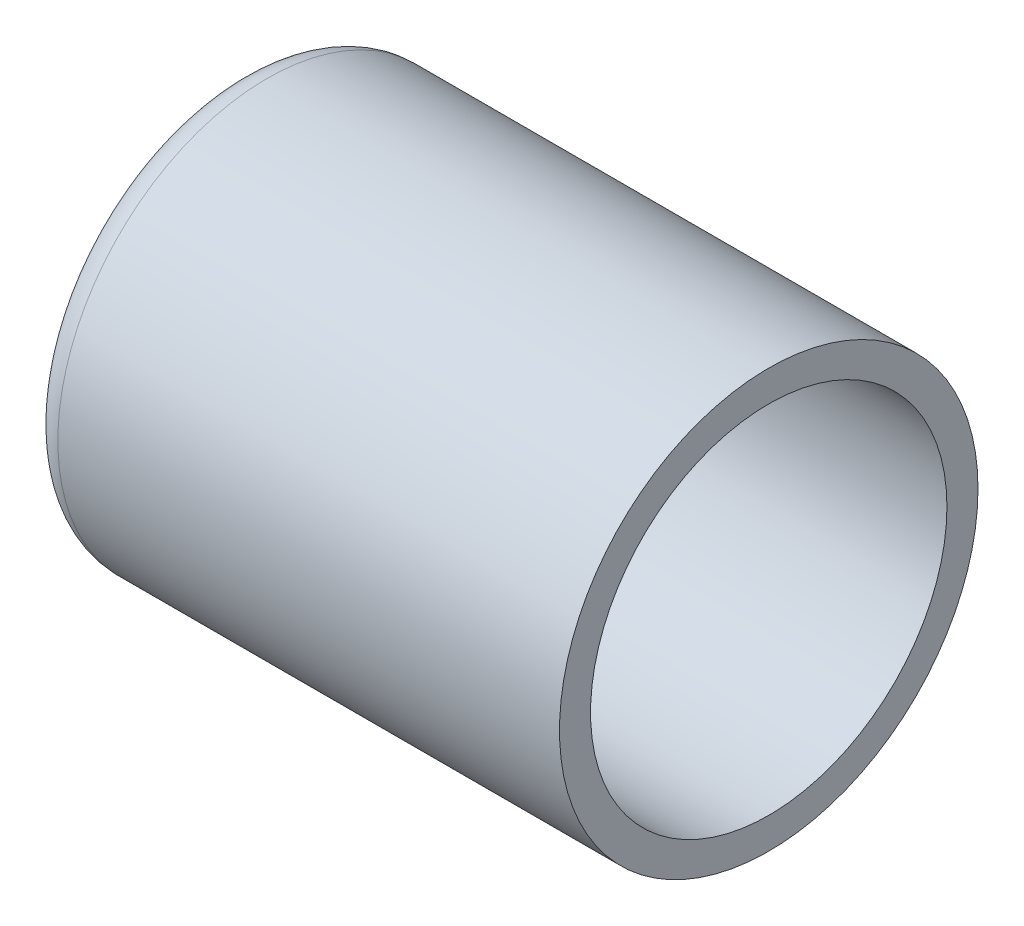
from build123d import *

# Parameters (mm, degrees)
SKETCH1_R           = 5.5626
BOSS_EXTRUDE1_DEPTH = 14.097
SKETCH2_R           = 4.7371
CUT_EXTRUDE1_DEPTH  = 11.684
FILLET1_R           = 0.762
CUT_EXTRUDE2_REACH  = 18.143
SKETCH3_R           = 1.5875
CHAMFER1_SIZE       = 0.635


with BuildPart() as part:
    # Sketch1 → Boss-Extrude1 (new body)
    with BuildSketch(Plane(origin=(0, 0, 0), x_dir=(0, 0, -1), z_dir=(1, 0, 0))):
        Circle(SKETCH1_R)
    extrude(amount=BOSS_EXTRUDE1_DEPTH)

    # Sketch2 → Cut-Extrude1 (cut)
    with BuildSketch(Plane(origin=(14.097, 0, 0), x_dir=(0, 0, -1), z_dir=(1, 0, 0))):
        Circle(SKETCH2_R)
    extrude(amount=-CUT_EXTRUDE1_DEPTH, mode=Mode.SUBTRACT)

    # Fillet1
    fillet1_edges = [part.edges().sort_by_distance(p)[0] for p in [
        (0, 0, 5.5626),
    ]]
    fillet(fillet1_edges, radius=FILLET1_R)

    # Sketch3 → Cut-Extrude2 (cut, up to next)
    with BuildSketch(Plane.ZY, mode=Mode.PRIVATE) as cut_extrude2_sk1:
        Circle(SKETCH3_R)
    cut_extrude2_tool1 = extrude(cut_extrude2_sk1.sketch, amount=-CUT_EXTRUDE2_REACH, mode=Mode.PRIVATE) & part.part
    add(cut_extrude2_tool1.solids().sort_by_distance((0, 0, 0))[0], mode=Mode.SUBTRACT)

    # Chamfer1
    chamfer1_edges = [part.edges().sort_by_distance(p)[0] for p in [
        (0, 0, -1.5875),
    ]]
    chamfer(chamfer1_edges, length=CHAMFER1_SIZE)


solid = part.part
